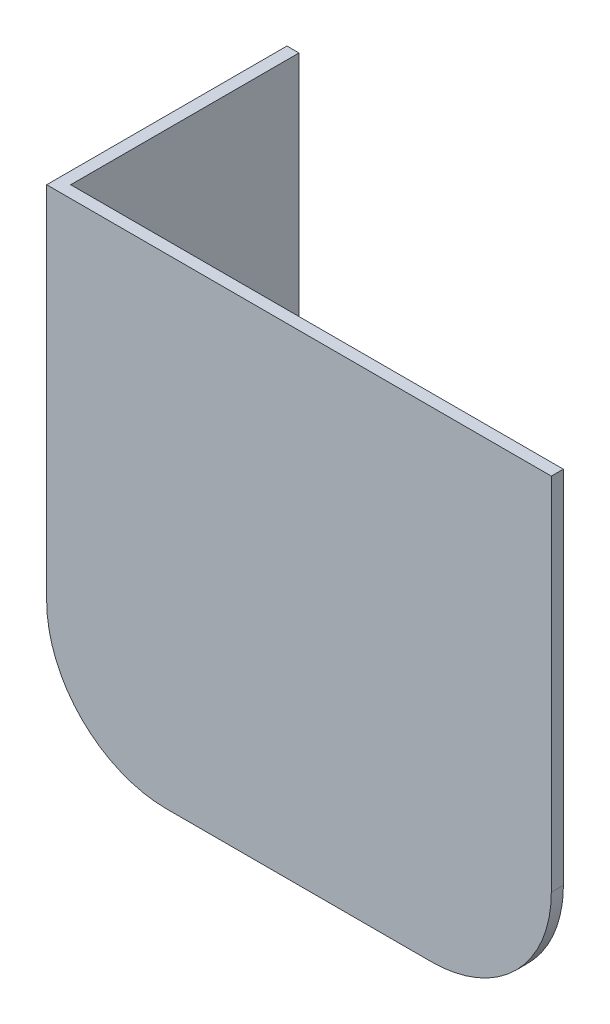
from build123d import *

# Parameters (mm, degrees)
EXTRUDE1_DEPTH = 508
SKETCH2_W      = 241.304085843
SKETCH2_H      = 127
EXTRUDE2_DEPTH = 780.163371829
FILLET1_R      = 127
FILLET2_R      = 127


with BuildPart() as part:
    # Sketch1 → Extrude1 (new body)
    with BuildSketch(Plane(origin=(0, 0, 0), x_dir=(1, 0, 0), z_dir=(0, 1, 0))):
        Polygon((0, 0), (0, 254), (12.7, 254), (12.7, 12.7), (533.4, 12.7), (533.4, 0), align=None)
    extrude(amount=-EXTRUDE1_DEPTH)

    # Sketch2 → Extrude2 (cut, through all)
    with BuildSketch(Plane.ZY):
        with Locations((-133.347957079, -462.28)):
            Rectangle(SKETCH2_W, SKETCH2_H)
    extrude(amount=-EXTRUDE2_DEPTH, mode=Mode.SUBTRACT)

    # Fillet1
    fillet1_edges = [part.edges().sort_by_distance(p)[0] for p in [
        (0, -508, -6.347957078),
    ]]
    fillet(fillet1_edges, radius=FILLET1_R)

    # Fillet2
    fillet2_edges = [part.edges().sort_by_distance(p)[0] for p in [
        (533.4, -508, -6.347957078),
    ]]
    fillet(fillet2_edges, radius=FILLET2_R)


solid = part.part
